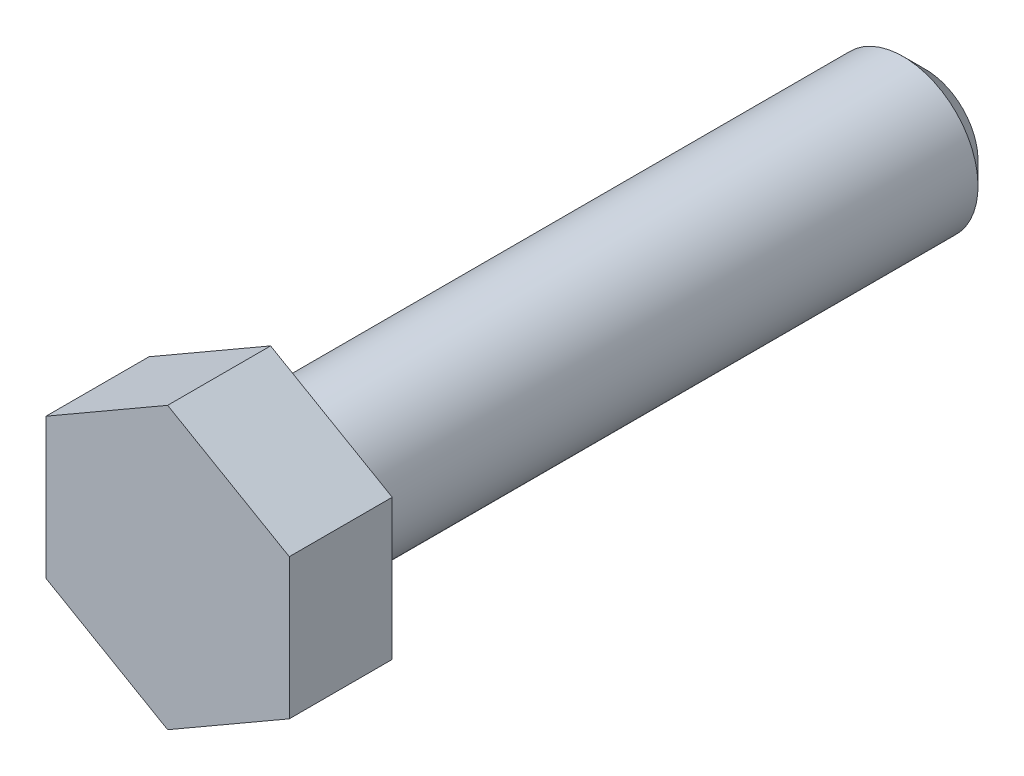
ISO-10303-21;
HEADER;
FILE_DESCRIPTION(('STEP AP214'),'2;1');
FILE_NAME('part.step','',(''),(''),'','','');
FILE_SCHEMA(('AUTOMOTIVE_DESIGN { 1 0 10303 214 1 1 1 1 }'));
ENDSEC;
DATA;
#1=APPLICATION_CONTEXT('core data for automotive mechanical design processes');
#2=APPLICATION_PROTOCOL_DEFINITION('international standard','automotive_design',2000,#1);
#3=PRODUCT_CONTEXT('',#1,'mechanical');
#4=PRODUCT('Part','Part','',(#3));
#5=PRODUCT_RELATED_PRODUCT_CATEGORY('part','',(#4));
#6=PRODUCT_DEFINITION_FORMATION('','',#4);
#7=PRODUCT_DEFINITION_CONTEXT('part definition',#1,'design');
#8=PRODUCT_DEFINITION('design','',#6,#7);
#9=PRODUCT_DEFINITION_SHAPE('','',#8);
#10=(LENGTH_UNIT() NAMED_UNIT(*) SI_UNIT(.MILLI.,.METRE.));
#11=(NAMED_UNIT(*) PLANE_ANGLE_UNIT() SI_UNIT($,.RADIAN.));
#12=(NAMED_UNIT(*) SI_UNIT($,.STERADIAN.) SOLID_ANGLE_UNIT());
#13=UNCERTAINTY_MEASURE_WITH_UNIT(LENGTH_MEASURE(1.E-05),#10,'distance_accuracy_value','');
#14=(GEOMETRIC_REPRESENTATION_CONTEXT(3) GLOBAL_UNCERTAINTY_ASSIGNED_CONTEXT((#13)) GLOBAL_UNIT_ASSIGNED_CONTEXT((#10,
#11,#12)) REPRESENTATION_CONTEXT('',''));
#15=CARTESIAN_POINT('',(0.,0.,0.));
#16=DIRECTION('',(0.,0.,1.));
#17=DIRECTION('',(1.,0.,0.));
#18=AXIS2_PLACEMENT_3D('',#15,#16,#17);
#19=CARTESIAN_POINT('',(-6.5,11.2583302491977,0.));
#20=DIRECTION('',(0.,0.,1.));
#21=DIRECTION('',(0.,-1.,0.));
#22=AXIS2_PLACEMENT_3D('',#19,#20,#21);
#23=PLANE('',#22);
#24=DIRECTION('',(-0.866025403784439,0.5,0.));
#25=VECTOR('',#24,1.);
#26=CARTESIAN_POINT('',(6.5,3.75277674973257,0.));
#27=LINE('',#26,#25);
#28=CARTESIAN_POINT('',(6.5,3.75277674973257,0.));
#29=VERTEX_POINT('',#28);
#30=CARTESIAN_POINT('',(0.,7.50555349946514,0.));
#31=VERTEX_POINT('',#30);
#32=EDGE_CURVE('E100',#29,#31,#27,.T.);
#33=ORIENTED_EDGE('',*,*,#32,.F.);
#34=DIRECTION('',(0.,1.,0.));
#35=VECTOR('',#34,1.);
#36=CARTESIAN_POINT('',(6.5,-3.75277674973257,0.));
#37=LINE('',#36,#35);
#38=CARTESIAN_POINT('',(6.5,-3.75277674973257,0.));
#39=VERTEX_POINT('',#38);
#40=EDGE_CURVE('E60',#39,#29,#37,.T.);
#41=ORIENTED_EDGE('',*,*,#40,.F.);
#42=DIRECTION('',(0.866025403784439,0.5,0.));
#43=VECTOR('',#42,1.);
#44=CARTESIAN_POINT('',(0.,-7.50555349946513,0.));
#45=LINE('',#44,#43);
#46=CARTESIAN_POINT('',(0.,-7.50555349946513,0.));
#47=VERTEX_POINT('',#46);
#48=EDGE_CURVE('E54',#47,#39,#45,.T.);
#49=ORIENTED_EDGE('',*,*,#48,.F.);
#50=DIRECTION('',(0.866025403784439,-0.5,0.));
#51=VECTOR('',#50,1.);
#52=CARTESIAN_POINT('',(-6.5,-3.75277674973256,0.));
#53=LINE('',#52,#51);
#54=CARTESIAN_POINT('',(-6.5,-3.75277674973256,0.));
#55=VERTEX_POINT('',#54);
#56=EDGE_CURVE('E90',#55,#47,#53,.T.);
#57=ORIENTED_EDGE('',*,*,#56,.F.);
#58=DIRECTION('',(0.,-1.,0.));
#59=VECTOR('',#58,1.);
#60=CARTESIAN_POINT('',(-6.5,3.75277674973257,0.));
#61=LINE('',#60,#59);
#62=CARTESIAN_POINT('',(-6.5,3.75277674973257,0.));
#63=VERTEX_POINT('',#62);
#64=EDGE_CURVE('E105',#63,#55,#61,.T.);
#65=ORIENTED_EDGE('',*,*,#64,.F.);
#66=DIRECTION('',(-0.866025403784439,-0.5,0.));
#67=VECTOR('',#66,1.);
#68=CARTESIAN_POINT('',(0.,7.50555349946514,0.));
#69=LINE('',#68,#67);
#70=EDGE_CURVE('E103',#31,#63,#69,.T.);
#71=ORIENTED_EDGE('',*,*,#70,.F.);
#72=EDGE_LOOP('',(#33,#41,#49,#57,#65,#71));
#73=FACE_BOUND('',#72,.T.);
#74=CARTESIAN_POINT('',(0.,0.,0.));
#75=DIRECTION('',(0.,0.,1.));
#76=DIRECTION('',(0.,-1.,0.));
#77=AXIS2_PLACEMENT_3D('',#74,#75,#76);
#78=CIRCLE('',#77,4.);
#79=CARTESIAN_POINT('',(0.,-4.,0.));
#80=VERTEX_POINT('',#79);
#81=EDGE_CURVE('E119',#80,#80,#78,.F.);
#82=ORIENTED_EDGE('',*,*,#81,.F.);
#83=EDGE_LOOP('',(#82));
#84=FACE_BOUND('',#83,.T.);
#85=ADVANCED_FACE('F14',(#73,#84),#23,.F.);
#86=CARTESIAN_POINT('',(6.5,3.75277674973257,5.5));
#87=DIRECTION('',(-0.5,-0.866025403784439,0.));
#88=DIRECTION('',(0.866025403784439,-0.5,0.));
#89=AXIS2_PLACEMENT_3D('',#86,#87,#88);
#90=PLANE('',#89);
#91=ORIENTED_EDGE('',*,*,#32,.T.);
#92=DIRECTION('',(0.,0.,-1.));
#93=VECTOR('',#92,1.);
#94=CARTESIAN_POINT('',(0.,7.50555349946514,5.5));
#95=LINE('',#94,#93);
#96=CARTESIAN_POINT('',(0.,7.50555349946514,5.5));
#97=VERTEX_POINT('',#96);
#98=EDGE_CURVE('E117',#97,#31,#95,.T.);
#99=ORIENTED_EDGE('',*,*,#98,.F.);
#100=DIRECTION('',(-0.866025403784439,0.5,0.));
#101=VECTOR('',#100,1.);
#102=CARTESIAN_POINT('',(6.5,3.75277674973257,5.5));
#103=LINE('',#102,#101);
#104=CARTESIAN_POINT('',(6.5,3.75277674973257,5.5));
#105=VERTEX_POINT('',#104);
#106=EDGE_CURVE('E110',#105,#97,#103,.T.);
#107=ORIENTED_EDGE('',*,*,#106,.F.);
#108=DIRECTION('',(0.,0.,-1.));
#109=VECTOR('',#108,1.);
#110=CARTESIAN_POINT('',(6.5,3.75277674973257,5.5));
#111=LINE('',#110,#109);
#112=EDGE_CURVE('E96',#105,#29,#111,.T.);
#113=ORIENTED_EDGE('',*,*,#112,.T.);
#114=EDGE_LOOP('',(#91,#99,#107,#113));
#115=FACE_BOUND('',#114,.T.);
#116=ADVANCED_FACE('F138',(#115),#90,.F.);
#117=CARTESIAN_POINT('',(0.,7.50555349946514,5.5));
#118=DIRECTION('',(0.5,-0.866025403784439,0.));
#119=DIRECTION('',(0.866025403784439,0.5,0.));
#120=AXIS2_PLACEMENT_3D('',#117,#118,#119);
#121=PLANE('',#120);
#122=ORIENTED_EDGE('',*,*,#70,.T.);
#123=DIRECTION('',(0.,0.,-1.));
#124=VECTOR('',#123,1.);
#125=CARTESIAN_POINT('',(-6.5,3.75277674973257,5.5));
#126=LINE('',#125,#124);
#127=CARTESIAN_POINT('',(-6.5,3.75277674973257,5.5));
#128=VERTEX_POINT('',#127);
#129=EDGE_CURVE('E114',#128,#63,#126,.T.);
#130=ORIENTED_EDGE('',*,*,#129,.F.);
#131=DIRECTION('',(-0.866025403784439,-0.5,0.));
#132=VECTOR('',#131,1.);
#133=CARTESIAN_POINT('',(0.,7.50555349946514,5.5));
#134=LINE('',#133,#132);
#135=EDGE_CURVE('E69',#97,#128,#134,.T.);
#136=ORIENTED_EDGE('',*,*,#135,.F.);
#137=ORIENTED_EDGE('',*,*,#98,.T.);
#138=EDGE_LOOP('',(#122,#130,#136,#137));
#139=FACE_BOUND('',#138,.T.);
#140=ADVANCED_FACE('F145',(#139),#121,.F.);
#141=CARTESIAN_POINT('',(-6.5,3.75277674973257,5.5));
#142=DIRECTION('',(1.,0.,0.));
#143=DIRECTION('',(0.,1.,0.));
#144=AXIS2_PLACEMENT_3D('',#141,#142,#143);
#145=PLANE('',#144);
#146=ORIENTED_EDGE('',*,*,#64,.T.);
#147=DIRECTION('',(0.,0.,-1.));
#148=VECTOR('',#147,1.);
#149=CARTESIAN_POINT('',(-6.5,-3.75277674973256,5.5));
#150=LINE('',#149,#148);
#151=CARTESIAN_POINT('',(-6.5,-3.75277674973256,5.5));
#152=VERTEX_POINT('',#151);
#153=EDGE_CURVE('E91',#152,#55,#150,.T.);
#154=ORIENTED_EDGE('',*,*,#153,.F.);
#155=DIRECTION('',(0.,-1.,0.));
#156=VECTOR('',#155,1.);
#157=CARTESIAN_POINT('',(-6.5,3.75277674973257,5.5));
#158=LINE('',#157,#156);
#159=EDGE_CURVE('E82',#128,#152,#158,.T.);
#160=ORIENTED_EDGE('',*,*,#159,.F.);
#161=ORIENTED_EDGE('',*,*,#129,.T.);
#162=EDGE_LOOP('',(#146,#154,#160,#161));
#163=FACE_BOUND('',#162,.T.);
#164=ADVANCED_FACE('F159',(#163),#145,.F.);
#165=CARTESIAN_POINT('',(-6.5,-3.75277674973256,5.5));
#166=DIRECTION('',(0.5,0.866025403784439,0.));
#167=DIRECTION('',(-0.866025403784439,0.5,0.));
#168=AXIS2_PLACEMENT_3D('',#165,#166,#167);
#169=PLANE('',#168);
#170=ORIENTED_EDGE('',*,*,#56,.T.);
#171=DIRECTION('',(0.,0.,-1.));
#172=VECTOR('',#171,1.);
#173=CARTESIAN_POINT('',(0.,-7.50555349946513,5.5));
#174=LINE('',#173,#172);
#175=CARTESIAN_POINT('',(0.,-7.50555349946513,5.5));
#176=VERTEX_POINT('',#175);
#177=EDGE_CURVE('E87',#176,#47,#174,.T.);
#178=ORIENTED_EDGE('',*,*,#177,.F.);
#179=DIRECTION('',(0.866025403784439,-0.5,0.));
#180=VECTOR('',#179,1.);
#181=CARTESIAN_POINT('',(-6.5,-3.75277674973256,5.5));
#182=LINE('',#181,#180);
#183=EDGE_CURVE('E76',#152,#176,#182,.T.);
#184=ORIENTED_EDGE('',*,*,#183,.F.);
#185=ORIENTED_EDGE('',*,*,#153,.T.);
#186=EDGE_LOOP('',(#170,#178,#184,#185));
#187=FACE_BOUND('',#186,.T.);
#188=ADVANCED_FACE('F88',(#187),#169,.F.);
#189=CARTESIAN_POINT('',(0.,-7.50555349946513,5.5));
#190=DIRECTION('',(-0.5,0.866025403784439,0.));
#191=DIRECTION('',(-0.866025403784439,-0.5,0.));
#192=AXIS2_PLACEMENT_3D('',#189,#190,#191);
#193=PLANE('',#192);
#194=ORIENTED_EDGE('',*,*,#48,.T.);
#195=DIRECTION('',(0.,0.,-1.));
#196=VECTOR('',#195,1.);
#197=CARTESIAN_POINT('',(6.5,-3.75277674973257,5.5));
#198=LINE('',#197,#196);
#199=CARTESIAN_POINT('',(6.5,-3.75277674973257,5.5));
#200=VERTEX_POINT('',#199);
#201=EDGE_CURVE('E92',#200,#39,#198,.T.);
#202=ORIENTED_EDGE('',*,*,#201,.F.);
#203=DIRECTION('',(0.866025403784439,0.5,0.));
#204=VECTOR('',#203,1.);
#205=CARTESIAN_POINT('',(0.,-7.50555349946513,5.5));
#206=LINE('',#205,#204);
#207=EDGE_CURVE('E80',#176,#200,#206,.T.);
#208=ORIENTED_EDGE('',*,*,#207,.F.);
#209=ORIENTED_EDGE('',*,*,#177,.T.);
#210=EDGE_LOOP('',(#194,#202,#208,#209));
#211=FACE_BOUND('',#210,.T.);
#212=ADVANCED_FACE('F94',(#211),#193,.F.);
#213=CARTESIAN_POINT('',(6.5,-3.75277674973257,5.5));
#214=DIRECTION('',(-1.,0.,0.));
#215=DIRECTION('',(0.,-1.,0.));
#216=AXIS2_PLACEMENT_3D('',#213,#214,#215);
#217=PLANE('',#216);
#218=ORIENTED_EDGE('',*,*,#40,.T.);
#219=ORIENTED_EDGE('',*,*,#112,.F.);
#220=DIRECTION('',(0.,1.,0.));
#221=VECTOR('',#220,1.);
#222=CARTESIAN_POINT('',(6.5,-3.75277674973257,5.5));
#223=LINE('',#222,#221);
#224=EDGE_CURVE('E31',#200,#105,#223,.T.);
#225=ORIENTED_EDGE('',*,*,#224,.F.);
#226=ORIENTED_EDGE('',*,*,#201,.T.);
#227=EDGE_LOOP('',(#218,#219,#225,#226));
#228=FACE_BOUND('',#227,.T.);
#229=ADVANCED_FACE('F152',(#228),#217,.F.);
#230=CARTESIAN_POINT('',(-6.5,11.2583302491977,5.5));
#231=DIRECTION('',(0.,0.,1.));
#232=DIRECTION('',(0.,-1.,0.));
#233=AXIS2_PLACEMENT_3D('',#230,#231,#232);
#234=PLANE('',#233);
#235=ORIENTED_EDGE('',*,*,#106,.T.);
#236=ORIENTED_EDGE('',*,*,#135,.T.);
#237=ORIENTED_EDGE('',*,*,#159,.T.);
#238=ORIENTED_EDGE('',*,*,#183,.T.);
#239=ORIENTED_EDGE('',*,*,#207,.T.);
#240=ORIENTED_EDGE('',*,*,#224,.T.);
#241=EDGE_LOOP('',(#235,#236,#237,#238,#239,#240));
#242=FACE_BOUND('',#241,.T.);
#243=ADVANCED_FACE('F78',(#242),#234,.T.);
#244=CARTESIAN_POINT('',(0.,0.,-35.));
#245=DIRECTION('',(0.,0.,1.));
#246=DIRECTION('',(0.,-1.,0.));
#247=AXIS2_PLACEMENT_3D('',#244,#245,#246);
#248=PLANE('',#247);
#249=CARTESIAN_POINT('',(0.,0.,-35.));
#250=DIRECTION('',(0.,0.,1.));
#251=DIRECTION('',(0.,-1.,0.));
#252=AXIS2_PLACEMENT_3D('',#249,#250,#251);
#253=CIRCLE('',#252,2.8);
#254=CARTESIAN_POINT('',(0.,-2.8,-35.));
#255=VERTEX_POINT('',#254);
#256=EDGE_CURVE('E9',#255,#255,#253,.F.);
#257=ORIENTED_EDGE('',*,*,#256,.T.);
#258=EDGE_LOOP('',(#257));
#259=FACE_BOUND('',#258,.T.);
#260=ADVANCED_FACE('F134',(#259),#248,.F.);
#261=CARTESIAN_POINT('',(0.,0.,0.));
#262=DIRECTION('',(0.,0.,1.));
#263=DIRECTION('',(0.,-1.,0.));
#264=AXIS2_PLACEMENT_3D('',#261,#262,#263);
#265=CYLINDRICAL_SURFACE('',#264,4.);
#266=CARTESIAN_POINT('',(0.,0.,-33.8));
#267=DIRECTION('',(0.,0.,1.));
#268=DIRECTION('',(0.,-1.,0.));
#269=AXIS2_PLACEMENT_3D('',#266,#267,#268);
#270=CIRCLE('',#269,4.);
#271=CARTESIAN_POINT('',(0.,-4.,-33.8));
#272=VERTEX_POINT('',#271);
#273=EDGE_CURVE('E23',#272,#272,#270,.T.);
#274=ORIENTED_EDGE('',*,*,#273,.T.);
#275=EDGE_LOOP('',(#274));
#276=FACE_BOUND('',#275,.T.);
#277=ORIENTED_EDGE('',*,*,#81,.T.);
#278=EDGE_LOOP('',(#277));
#279=FACE_BOUND('',#278,.T.);
#280=ADVANCED_FACE('F124',(#276,#279),#265,.T.);
#281=CARTESIAN_POINT('',(0.,0.,-33.8));
#282=DIRECTION('',(0.,0.,1.));
#283=DIRECTION('',(0.,-1.,0.));
#284=AXIS2_PLACEMENT_3D('',#281,#282,#283);
#285=CONICAL_SURFACE('',#284,4.,0.78539816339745);
#286=ORIENTED_EDGE('',*,*,#256,.F.);
#287=EDGE_LOOP('',(#286));
#288=FACE_BOUND('',#287,.T.);
#289=ORIENTED_EDGE('',*,*,#273,.F.);
#290=EDGE_LOOP('',(#289));
#291=FACE_BOUND('',#290,.T.);
#292=ADVANCED_FACE('F16',(#288,#291),#285,.T.);
#293=CLOSED_SHELL('',(#85,#116,#140,#164,#188,#212,#229,#243,#260,#280,#292));
#294=MANIFOLD_SOLID_BREP('B1',#293);
#295=ADVANCED_BREP_SHAPE_REPRESENTATION('',(#18,#294),#14);
#296=SHAPE_DEFINITION_REPRESENTATION(#9,#295);
ENDSEC;
END-ISO-10303-21;
